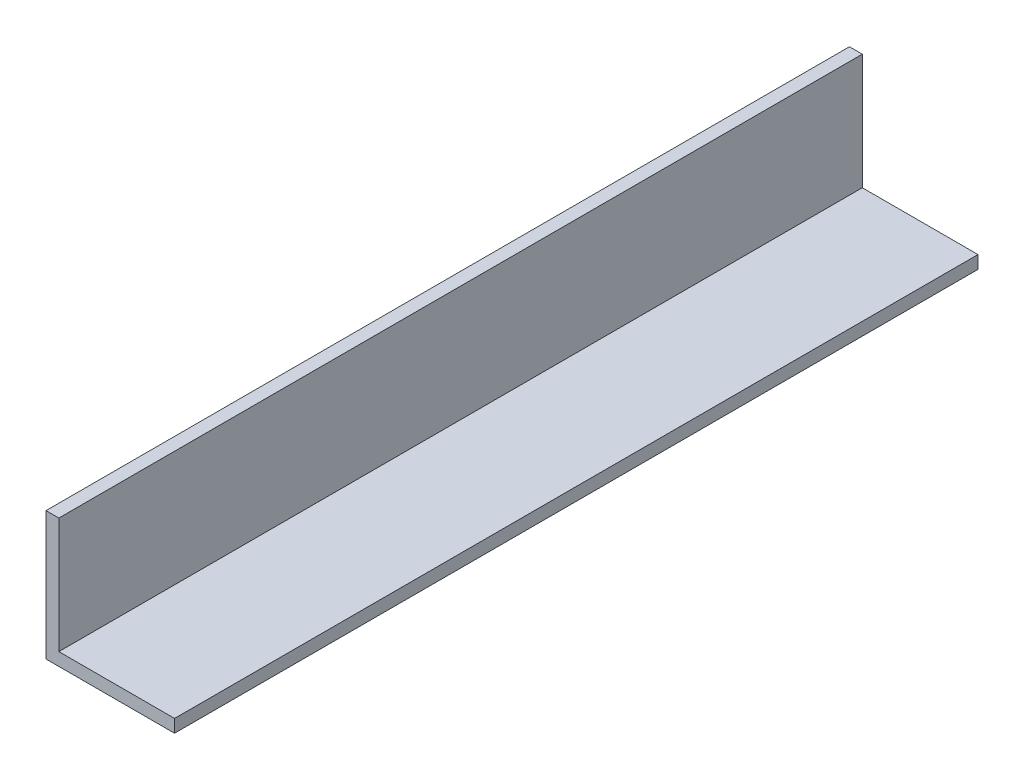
ISO-10303-21;
HEADER;
FILE_DESCRIPTION(('STEP AP214'),'2;1');
FILE_NAME('part.step','',(''),(''),'','','');
FILE_SCHEMA(('AUTOMOTIVE_DESIGN { 1 0 10303 214 1 1 1 1 }'));
ENDSEC;
DATA;
#1=APPLICATION_CONTEXT('core data for automotive mechanical design processes');
#2=APPLICATION_PROTOCOL_DEFINITION('international standard','automotive_design',2000,#1);
#3=PRODUCT_CONTEXT('',#1,'mechanical');
#4=PRODUCT('Part','Part','',(#3));
#5=PRODUCT_RELATED_PRODUCT_CATEGORY('part','',(#4));
#6=PRODUCT_DEFINITION_FORMATION('','',#4);
#7=PRODUCT_DEFINITION_CONTEXT('part definition',#1,'design');
#8=PRODUCT_DEFINITION('design','',#6,#7);
#9=PRODUCT_DEFINITION_SHAPE('','',#8);
#10=(LENGTH_UNIT() NAMED_UNIT(*) SI_UNIT(.MILLI.,.METRE.));
#11=(NAMED_UNIT(*) PLANE_ANGLE_UNIT() SI_UNIT($,.RADIAN.));
#12=(NAMED_UNIT(*) SI_UNIT($,.STERADIAN.) SOLID_ANGLE_UNIT());
#13=UNCERTAINTY_MEASURE_WITH_UNIT(LENGTH_MEASURE(1.E-05),#10,'distance_accuracy_value','');
#14=(GEOMETRIC_REPRESENTATION_CONTEXT(3) GLOBAL_UNCERTAINTY_ASSIGNED_CONTEXT((#13)) GLOBAL_UNIT_ASSIGNED_CONTEXT((#10,
#11,#12)) REPRESENTATION_CONTEXT('',''));
#15=CARTESIAN_POINT('',(0.,0.,0.));
#16=DIRECTION('',(0.,0.,1.));
#17=DIRECTION('',(1.,0.,0.));
#18=AXIS2_PLACEMENT_3D('',#15,#16,#17);
#19=CARTESIAN_POINT('',(-1.11022302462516E-13,-4.44089209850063E-13,125.));
#20=DIRECTION('',(0.,1.,0.));
#21=DIRECTION('',(0.,0.,1.));
#22=AXIS2_PLACEMENT_3D('',#19,#20,#21);
#23=PLANE('',#22);
#24=DIRECTION('',(1.,0.,0.));
#25=VECTOR('',#24,1.);
#26=CARTESIAN_POINT('',(0.,0.,-125.));
#27=LINE('',#26,#25);
#28=CARTESIAN_POINT('',(0.,0.,-125.));
#29=VERTEX_POINT('',#28);
#30=CARTESIAN_POINT('',(40.,0.,-125.));
#31=VERTEX_POINT('',#30);
#32=EDGE_CURVE('E404',#29,#31,#27,.T.);
#33=ORIENTED_EDGE('',*,*,#32,.T.);
#34=DIRECTION('',(0.,0.,-1.));
#35=VECTOR('',#34,1.);
#36=CARTESIAN_POINT('',(39.9999999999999,-4.44089209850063E-13,125.));
#37=LINE('',#36,#35);
#38=CARTESIAN_POINT('',(39.9999999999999,-4.44089209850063E-13,125.));
#39=VERTEX_POINT('',#38);
#40=EDGE_CURVE('E11',#39,#31,#37,.T.);
#41=ORIENTED_EDGE('',*,*,#40,.F.);
#42=DIRECTION('',(1.,0.,0.));
#43=VECTOR('',#42,1.);
#44=CARTESIAN_POINT('',(-1.11022302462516E-13,-4.44089209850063E-13,125.));
#45=LINE('',#44,#43);
#46=CARTESIAN_POINT('',(-1.11022302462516E-13,-4.44089209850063E-13,125.));
#47=VERTEX_POINT('',#46);
#48=EDGE_CURVE('E427',#47,#39,#45,.T.);
#49=ORIENTED_EDGE('',*,*,#48,.F.);
#50=DIRECTION('',(0.,0.,-1.));
#51=VECTOR('',#50,1.);
#52=CARTESIAN_POINT('',(-1.11022302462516E-13,-4.44089209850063E-13,125.));
#53=LINE('',#52,#51);
#54=EDGE_CURVE('E417',#47,#29,#53,.T.);
#55=ORIENTED_EDGE('',*,*,#54,.T.);
#56=EDGE_LOOP('',(#33,#41,#49,#55));
#57=FACE_BOUND('',#56,.T.);
#58=ADVANCED_FACE('F348',(#57),#23,.F.);
#59=CARTESIAN_POINT('',(39.9999999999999,-4.44089209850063E-13,125.));
#60=DIRECTION('',(-1.,0.,0.));
#61=DIRECTION('',(0.,0.,1.));
#62=AXIS2_PLACEMENT_3D('',#59,#60,#61);
#63=PLANE('',#62);
#64=DIRECTION('',(0.,1.,0.));
#65=VECTOR('',#64,1.);
#66=CARTESIAN_POINT('',(40.,0.,-125.));
#67=LINE('',#66,#65);
#68=CARTESIAN_POINT('',(40.,4.,-125.));
#69=VERTEX_POINT('',#68);
#70=EDGE_CURVE('E400',#31,#69,#67,.T.);
#71=ORIENTED_EDGE('',*,*,#70,.T.);
#72=DIRECTION('',(0.,0.,-1.));
#73=VECTOR('',#72,1.);
#74=CARTESIAN_POINT('',(39.9999999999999,3.99999999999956,125.));
#75=LINE('',#74,#73);
#76=CARTESIAN_POINT('',(39.9999999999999,3.99999999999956,125.));
#77=VERTEX_POINT('',#76);
#78=EDGE_CURVE('E355',#77,#69,#75,.T.);
#79=ORIENTED_EDGE('',*,*,#78,.F.);
#80=DIRECTION('',(0.,1.,0.));
#81=VECTOR('',#80,1.);
#82=CARTESIAN_POINT('',(39.9999999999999,-4.44089209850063E-13,125.));
#83=LINE('',#82,#81);
#84=EDGE_CURVE('E413',#39,#77,#83,.T.);
#85=ORIENTED_EDGE('',*,*,#84,.F.);
#86=ORIENTED_EDGE('',*,*,#40,.T.);
#87=EDGE_LOOP('',(#71,#79,#85,#86));
#88=FACE_BOUND('',#87,.T.);
#89=ADVANCED_FACE('F412',(#88),#63,.F.);
#90=CARTESIAN_POINT('',(39.9999999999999,3.99999999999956,125.));
#91=DIRECTION('',(0.,-1.,0.));
#92=DIRECTION('',(1.,0.,0.));
#93=AXIS2_PLACEMENT_3D('',#90,#91,#92);
#94=PLANE('',#93);
#95=DIRECTION('',(-1.,0.,0.));
#96=VECTOR('',#95,1.);
#97=CARTESIAN_POINT('',(40.,4.,-125.));
#98=LINE('',#97,#96);
#99=CARTESIAN_POINT('',(4.,4.,-125.));
#100=VERTEX_POINT('',#99);
#101=EDGE_CURVE('E406',#69,#100,#98,.T.);
#102=ORIENTED_EDGE('',*,*,#101,.T.);
#103=DIRECTION('',(0.,0.,-1.));
#104=VECTOR('',#103,1.);
#105=CARTESIAN_POINT('',(3.99999999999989,3.99999999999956,125.));
#106=LINE('',#105,#104);
#107=CARTESIAN_POINT('',(3.99999999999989,3.99999999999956,125.));
#108=VERTEX_POINT('',#107);
#109=EDGE_CURVE('E443',#108,#100,#106,.T.);
#110=ORIENTED_EDGE('',*,*,#109,.F.);
#111=DIRECTION('',(-1.,0.,0.));
#112=VECTOR('',#111,1.);
#113=CARTESIAN_POINT('',(39.9999999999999,3.99999999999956,125.));
#114=LINE('',#113,#112);
#115=EDGE_CURVE('E430',#77,#108,#114,.T.);
#116=ORIENTED_EDGE('',*,*,#115,.F.);
#117=ORIENTED_EDGE('',*,*,#78,.T.);
#118=EDGE_LOOP('',(#102,#110,#116,#117));
#119=FACE_BOUND('',#118,.T.);
#120=ADVANCED_FACE('F447',(#119),#94,.F.);
#121=CARTESIAN_POINT('',(3.99999999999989,3.99999999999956,125.));
#122=DIRECTION('',(-1.,0.,0.));
#123=DIRECTION('',(0.,0.,1.));
#124=AXIS2_PLACEMENT_3D('',#121,#122,#123);
#125=PLANE('',#124);
#126=DIRECTION('',(0.,1.,0.));
#127=VECTOR('',#126,1.);
#128=CARTESIAN_POINT('',(4.,4.,-125.));
#129=LINE('',#128,#127);
#130=CARTESIAN_POINT('',(4.,39.9999999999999,-125.));
#131=VERTEX_POINT('',#130);
#132=EDGE_CURVE('E421',#100,#131,#129,.T.);
#133=ORIENTED_EDGE('',*,*,#132,.T.);
#134=DIRECTION('',(0.,0.,-1.));
#135=VECTOR('',#134,1.);
#136=CARTESIAN_POINT('',(3.99999999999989,39.9999999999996,125.));
#137=LINE('',#136,#135);
#138=CARTESIAN_POINT('',(3.99999999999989,39.9999999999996,125.));
#139=VERTEX_POINT('',#138);
#140=EDGE_CURVE('E440',#139,#131,#137,.T.);
#141=ORIENTED_EDGE('',*,*,#140,.F.);
#142=DIRECTION('',(0.,1.,0.));
#143=VECTOR('',#142,1.);
#144=CARTESIAN_POINT('',(3.99999999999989,3.99999999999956,125.));
#145=LINE('',#144,#143);
#146=EDGE_CURVE('E432',#108,#139,#145,.T.);
#147=ORIENTED_EDGE('',*,*,#146,.F.);
#148=ORIENTED_EDGE('',*,*,#109,.T.);
#149=EDGE_LOOP('',(#133,#141,#147,#148));
#150=FACE_BOUND('',#149,.T.);
#151=ADVANCED_FACE('F453',(#150),#125,.F.);
#152=CARTESIAN_POINT('',(3.99999999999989,39.9999999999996,125.));
#153=DIRECTION('',(0.,-1.,0.));
#154=DIRECTION('',(0.,0.,-1.));
#155=AXIS2_PLACEMENT_3D('',#152,#153,#154);
#156=PLANE('',#155);
#157=DIRECTION('',(-1.,0.,0.));
#158=VECTOR('',#157,1.);
#159=CARTESIAN_POINT('',(4.,39.9999999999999,-125.));
#160=LINE('',#159,#158);
#161=CARTESIAN_POINT('',(0.,39.9999999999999,-125.));
#162=VERTEX_POINT('',#161);
#163=EDGE_CURVE('E423',#131,#162,#160,.T.);
#164=ORIENTED_EDGE('',*,*,#163,.T.);
#165=DIRECTION('',(0.,0.,-1.));
#166=VECTOR('',#165,1.);
#167=CARTESIAN_POINT('',(-1.11022302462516E-13,39.9999999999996,125.));
#168=LINE('',#167,#166);
#169=CARTESIAN_POINT('',(-1.11022302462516E-13,39.9999999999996,125.));
#170=VERTEX_POINT('',#169);
#171=EDGE_CURVE('E437',#170,#162,#168,.T.);
#172=ORIENTED_EDGE('',*,*,#171,.F.);
#173=DIRECTION('',(-1.,0.,0.));
#174=VECTOR('',#173,1.);
#175=CARTESIAN_POINT('',(3.99999999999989,39.9999999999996,125.));
#176=LINE('',#175,#174);
#177=EDGE_CURVE('E367',#139,#170,#176,.T.);
#178=ORIENTED_EDGE('',*,*,#177,.F.);
#179=ORIENTED_EDGE('',*,*,#140,.T.);
#180=EDGE_LOOP('',(#164,#172,#178,#179));
#181=FACE_BOUND('',#180,.T.);
#182=ADVANCED_FACE('F456',(#181),#156,.F.);
#183=CARTESIAN_POINT('',(-1.11022302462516E-13,-4.44089209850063E-13,125.));
#184=DIRECTION('',(1.,0.,0.));
#185=DIRECTION('',(0.,0.,-1.));
#186=AXIS2_PLACEMENT_3D('',#183,#184,#185);
#187=PLANE('',#186);
#188=DIRECTION('',(0.,-1.,0.));
#189=VECTOR('',#188,1.);
#190=CARTESIAN_POINT('',(0.,0.,-125.));
#191=LINE('',#190,#189);
#192=EDGE_CURVE('E425',#162,#29,#191,.T.);
#193=ORIENTED_EDGE('',*,*,#192,.T.);
#194=ORIENTED_EDGE('',*,*,#54,.F.);
#195=DIRECTION('',(0.,-1.,0.));
#196=VECTOR('',#195,1.);
#197=CARTESIAN_POINT('',(-1.11022302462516E-13,-4.44089209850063E-13,125.));
#198=LINE('',#197,#196);
#199=EDGE_CURVE('E362',#170,#47,#198,.T.);
#200=ORIENTED_EDGE('',*,*,#199,.F.);
#201=ORIENTED_EDGE('',*,*,#171,.T.);
#202=EDGE_LOOP('',(#193,#194,#200,#201));
#203=FACE_BOUND('',#202,.T.);
#204=ADVANCED_FACE('F458',(#203),#187,.F.);
#205=CARTESIAN_POINT('',(39.9999999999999,-4.44089209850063E-13,125.));
#206=DIRECTION('',(0.,0.,1.));
#207=DIRECTION('',(1.,0.,0.));
#208=AXIS2_PLACEMENT_3D('',#205,#206,#207);
#209=PLANE('',#208);
#210=ORIENTED_EDGE('',*,*,#48,.T.);
#211=ORIENTED_EDGE('',*,*,#84,.T.);
#212=ORIENTED_EDGE('',*,*,#115,.T.);
#213=ORIENTED_EDGE('',*,*,#146,.T.);
#214=ORIENTED_EDGE('',*,*,#177,.T.);
#215=ORIENTED_EDGE('',*,*,#199,.T.);
#216=EDGE_LOOP('',(#210,#211,#212,#213,#214,#215));
#217=FACE_BOUND('',#216,.T.);
#218=ADVANCED_FACE('F450',(#217),#209,.T.);
#219=CARTESIAN_POINT('',(40.,0.,-125.));
#220=DIRECTION('',(0.,0.,1.));
#221=DIRECTION('',(1.,0.,0.));
#222=AXIS2_PLACEMENT_3D('',#219,#220,#221);
#223=PLANE('',#222);
#224=ORIENTED_EDGE('',*,*,#32,.F.);
#225=ORIENTED_EDGE('',*,*,#192,.F.);
#226=ORIENTED_EDGE('',*,*,#163,.F.);
#227=ORIENTED_EDGE('',*,*,#132,.F.);
#228=ORIENTED_EDGE('',*,*,#101,.F.);
#229=ORIENTED_EDGE('',*,*,#70,.F.);
#230=EDGE_LOOP('',(#224,#225,#226,#227,#228,#229));
#231=FACE_BOUND('',#230,.T.);
#232=ADVANCED_FACE('F401',(#231),#223,.F.);
#233=CLOSED_SHELL('',(#58,#89,#120,#151,#182,#204,#218,#232));
#234=MANIFOLD_SOLID_BREP('B2',#233);
#235=ADVANCED_BREP_SHAPE_REPRESENTATION('',(#18,#234),#14);
#236=SHAPE_DEFINITION_REPRESENTATION(#9,#235);
ENDSEC;
END-ISO-10303-21;
